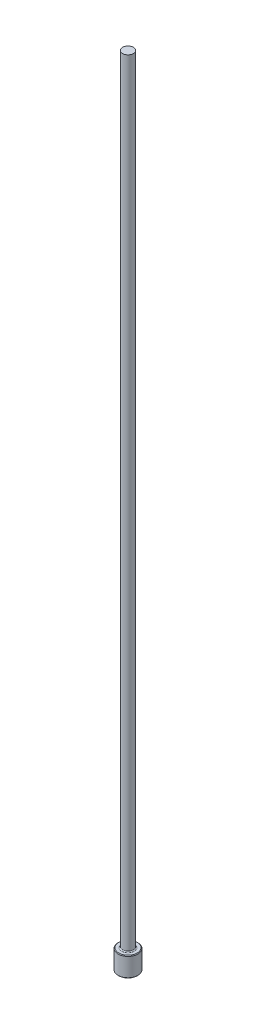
from build123d import *

# Parameters (mm, degrees)
CHAMFER1_SIZE = 0.0508
FILLET1_R     = 0.0762


with BuildPart() as part:
    # Sketch1 → Revolve1 (revolve)
    with BuildSketch(Plane.XY, mode=Mode.PRIVATE) as revolve1_sk:
        Polygon((0, 0), (-0.7874, 0), (-0.7874, 1.5748), (-0.4318, 1.5748), (-0.4318, 63.5), (0, 63.5), align=None)
    revolve(revolve1_sk.sketch.rotate(Axis((0, 259.958771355, 0), (0, -1, 0)), 270), axis=Axis((0, 259.958771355, 0), (0, -1, 0)))

    # Chamfer1
    chamfer1_edges = [part.edges().sort_by_distance(p)[0] for p in [
        (0, 1.5748, -0.7874),
        (0, 0, -0.7874),
    ]]
    chamfer(chamfer1_edges, length=CHAMFER1_SIZE)

    # Fillet1
    fillet1_edges = [part.edges().sort_by_distance(p)[0] for p in [
        (0, 1.5748, -0.4318),
    ]]
    fillet(fillet1_edges, radius=FILLET1_R)


solid = part.part
